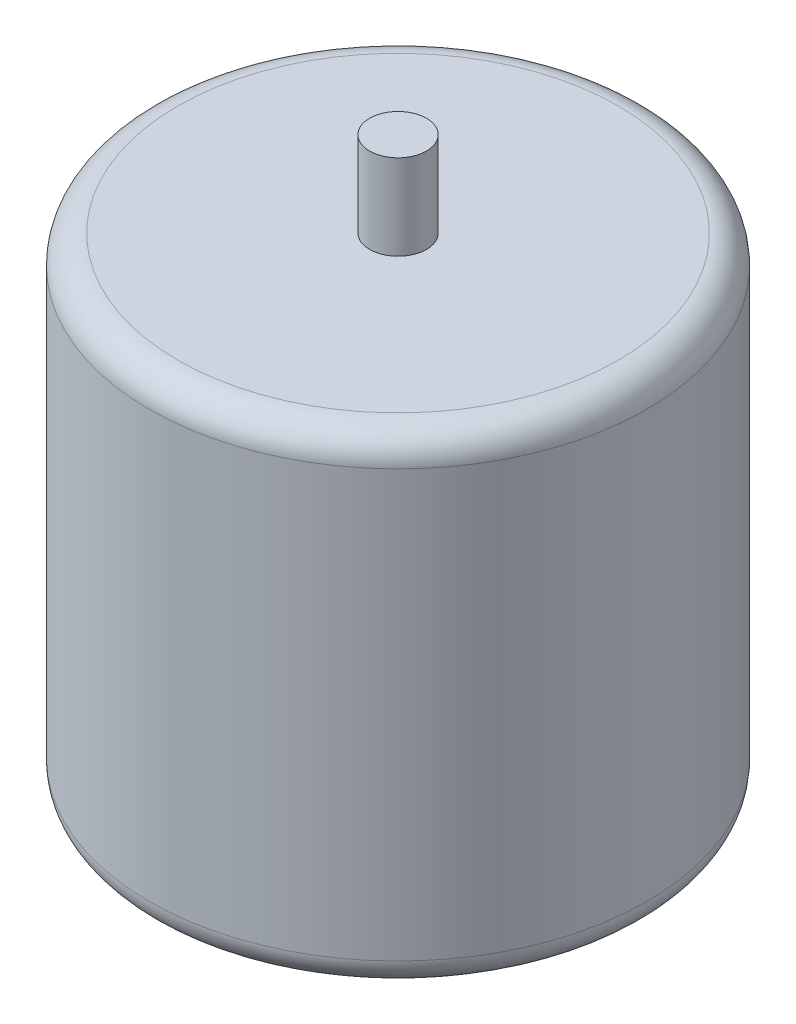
ISO-10303-21;
HEADER;
FILE_DESCRIPTION(('STEP AP214'),'2;1');
FILE_NAME('part.step','',(''),(''),'','','');
FILE_SCHEMA(('AUTOMOTIVE_DESIGN { 1 0 10303 214 1 1 1 1 }'));
ENDSEC;
DATA;
#1=APPLICATION_CONTEXT('core data for automotive mechanical design processes');
#2=APPLICATION_PROTOCOL_DEFINITION('international standard','automotive_design',2000,#1);
#3=PRODUCT_CONTEXT('',#1,'mechanical');
#4=PRODUCT('Part','Part','',(#3));
#5=PRODUCT_RELATED_PRODUCT_CATEGORY('part','',(#4));
#6=PRODUCT_DEFINITION_FORMATION('','',#4);
#7=PRODUCT_DEFINITION_CONTEXT('part definition',#1,'design');
#8=PRODUCT_DEFINITION('design','',#6,#7);
#9=PRODUCT_DEFINITION_SHAPE('','',#8);
#10=(LENGTH_UNIT() NAMED_UNIT(*) SI_UNIT(.MILLI.,.METRE.));
#11=(NAMED_UNIT(*) PLANE_ANGLE_UNIT() SI_UNIT($,.RADIAN.));
#12=(NAMED_UNIT(*) SI_UNIT($,.STERADIAN.) SOLID_ANGLE_UNIT());
#13=UNCERTAINTY_MEASURE_WITH_UNIT(LENGTH_MEASURE(1.E-05),#10,'distance_accuracy_value','');
#14=(GEOMETRIC_REPRESENTATION_CONTEXT(3) GLOBAL_UNCERTAINTY_ASSIGNED_CONTEXT((#13)) GLOBAL_UNIT_ASSIGNED_CONTEXT((#10,
#11,#12)) REPRESENTATION_CONTEXT('',''));
#15=CARTESIAN_POINT('',(0.,0.,0.));
#16=DIRECTION('',(0.,0.,1.));
#17=DIRECTION('',(1.,0.,0.));
#18=AXIS2_PLACEMENT_3D('',#15,#16,#17);
#19=CARTESIAN_POINT('',(0.,34.,0.));
#20=DIRECTION('',(0.,-1.,0.));
#21=DIRECTION('',(0.,0.,-1.));
#22=AXIS2_PLACEMENT_3D('',#19,#20,#21);
#23=CYLINDRICAL_SURFACE('',#22,17.5);
#24=CARTESIAN_POINT('',(0.,2.,0.));
#25=DIRECTION('',(0.,1.,0.));
#26=DIRECTION('',(0.,0.,1.));
#27=AXIS2_PLACEMENT_3D('',#24,#25,#26);
#28=CIRCLE('',#27,17.5);
#29=CARTESIAN_POINT('',(0.,2.,17.5));
#30=VERTEX_POINT('',#29);
#31=EDGE_CURVE('E56',#30,#30,#28,.T.);
#32=ORIENTED_EDGE('',*,*,#31,.T.);
#33=EDGE_LOOP('',(#32));
#34=FACE_BOUND('',#33,.T.);
#35=CARTESIAN_POINT('',(0.,32.,0.));
#36=DIRECTION('',(0.,1.,0.));
#37=DIRECTION('',(0.,0.,1.));
#38=AXIS2_PLACEMENT_3D('',#35,#36,#37);
#39=CIRCLE('',#38,17.5);
#40=CARTESIAN_POINT('',(0.,32.,17.5));
#41=VERTEX_POINT('',#40);
#42=EDGE_CURVE('E61',#41,#41,#39,.F.);
#43=ORIENTED_EDGE('',*,*,#42,.T.);
#44=EDGE_LOOP('',(#43));
#45=FACE_BOUND('',#44,.T.);
#46=ADVANCED_FACE('F43',(#34,#45),#23,.T.);
#47=CARTESIAN_POINT('',(0.,34.,0.));
#48=DIRECTION('',(0.,1.,0.));
#49=DIRECTION('',(0.,0.,1.));
#50=AXIS2_PLACEMENT_3D('',#47,#48,#49);
#51=PLANE('',#50);
#52=CARTESIAN_POINT('',(0.,34.,0.));
#53=DIRECTION('',(0.,1.,0.));
#54=DIRECTION('',(0.,0.,1.));
#55=AXIS2_PLACEMENT_3D('',#52,#53,#54);
#56=CIRCLE('',#55,2.);
#57=CARTESIAN_POINT('',(0.,34.,2.));
#58=VERTEX_POINT('',#57);
#59=EDGE_CURVE('E68',#58,#58,#56,.T.);
#60=ORIENTED_EDGE('',*,*,#59,.F.);
#61=EDGE_LOOP('',(#60));
#62=FACE_BOUND('',#61,.T.);
#63=CARTESIAN_POINT('',(0.,34.,0.));
#64=DIRECTION('',(0.,1.,0.));
#65=DIRECTION('',(0.,0.,1.));
#66=AXIS2_PLACEMENT_3D('',#63,#64,#65);
#67=CIRCLE('',#66,15.5);
#68=CARTESIAN_POINT('',(0.,34.,15.5));
#69=VERTEX_POINT('',#68);
#70=EDGE_CURVE('E10',#69,#69,#67,.T.);
#71=ORIENTED_EDGE('',*,*,#70,.T.);
#72=EDGE_LOOP('',(#71));
#73=FACE_BOUND('',#72,.T.);
#74=ADVANCED_FACE('F84',(#62,#73),#51,.T.);
#75=CARTESIAN_POINT('',(0.,0.,0.));
#76=DIRECTION('',(0.,1.,0.));
#77=DIRECTION('',(0.,0.,1.));
#78=AXIS2_PLACEMENT_3D('',#75,#76,#77);
#79=PLANE('',#78);
#80=CARTESIAN_POINT('',(0.,0.,0.));
#81=DIRECTION('',(0.,1.,0.));
#82=DIRECTION('',(0.,0.,1.));
#83=AXIS2_PLACEMENT_3D('',#80,#81,#82);
#84=CIRCLE('',#83,15.5);
#85=CARTESIAN_POINT('',(0.,0.,15.5));
#86=VERTEX_POINT('',#85);
#87=EDGE_CURVE('E51',#86,#86,#84,.F.);
#88=ORIENTED_EDGE('',*,*,#87,.T.);
#89=EDGE_LOOP('',(#88));
#90=FACE_BOUND('',#89,.T.);
#91=ADVANCED_FACE('F86',(#90),#79,.F.);
#92=CARTESIAN_POINT('',(0.,2.,0.));
#93=DIRECTION('',(0.,1.,0.));
#94=DIRECTION('',(0.,0.,1.));
#95=AXIS2_PLACEMENT_3D('',#92,#93,#94);
#96=TOROIDAL_SURFACE('',#95,15.5,2.);
#97=ORIENTED_EDGE('',*,*,#87,.F.);
#98=EDGE_LOOP('',(#97));
#99=FACE_BOUND('',#98,.T.);
#100=ORIENTED_EDGE('',*,*,#31,.F.);
#101=EDGE_LOOP('',(#100));
#102=FACE_BOUND('',#101,.T.);
#103=ADVANCED_FACE('F92',(#99,#102),#96,.T.);
#104=CARTESIAN_POINT('',(0.,32.,0.));
#105=DIRECTION('',(0.,1.,0.));
#106=DIRECTION('',(0.,0.,1.));
#107=AXIS2_PLACEMENT_3D('',#104,#105,#106);
#108=TOROIDAL_SURFACE('',#107,15.5,2.);
#109=ORIENTED_EDGE('',*,*,#42,.F.);
#110=EDGE_LOOP('',(#109));
#111=FACE_BOUND('',#110,.T.);
#112=ORIENTED_EDGE('',*,*,#70,.F.);
#113=EDGE_LOOP('',(#112));
#114=FACE_BOUND('',#113,.T.);
#115=ADVANCED_FACE('F45',(#111,#114),#108,.T.);
#116=CARTESIAN_POINT('',(0.,40.,0.));
#117=DIRECTION('',(0.,-1.,0.));
#118=DIRECTION('',(0.,0.,-1.));
#119=AXIS2_PLACEMENT_3D('',#116,#117,#118);
#120=CYLINDRICAL_SURFACE('',#119,2.);
#121=CARTESIAN_POINT('',(0.,40.,0.));
#122=DIRECTION('',(0.,1.,0.));
#123=DIRECTION('',(0.,0.,1.));
#124=AXIS2_PLACEMENT_3D('',#121,#122,#123);
#125=CIRCLE('',#124,2.);
#126=CARTESIAN_POINT('',(0.,40.,2.));
#127=VERTEX_POINT('',#126);
#128=EDGE_CURVE('E67',#127,#127,#125,.T.);
#129=ORIENTED_EDGE('',*,*,#128,.F.);
#130=EDGE_LOOP('',(#129));
#131=FACE_BOUND('',#130,.T.);
#132=ORIENTED_EDGE('',*,*,#59,.T.);
#133=EDGE_LOOP('',(#132));
#134=FACE_BOUND('',#133,.T.);
#135=ADVANCED_FACE('F78',(#131,#134),#120,.T.);
#136=CARTESIAN_POINT('',(0.,40.,0.));
#137=DIRECTION('',(0.,1.,0.));
#138=DIRECTION('',(0.,0.,1.));
#139=AXIS2_PLACEMENT_3D('',#136,#137,#138);
#140=PLANE('',#139);
#141=ORIENTED_EDGE('',*,*,#128,.T.);
#142=EDGE_LOOP('',(#141));
#143=FACE_BOUND('',#142,.T.);
#144=ADVANCED_FACE('F76',(#143),#140,.T.);
#145=CLOSED_SHELL('',(#46,#74,#91,#103,#115,#135,#144));
#146=MANIFOLD_SOLID_BREP('B2',#145);
#147=ADVANCED_BREP_SHAPE_REPRESENTATION('',(#18,#146),#14);
#148=SHAPE_DEFINITION_REPRESENTATION(#9,#147);
ENDSEC;
END-ISO-10303-21;
